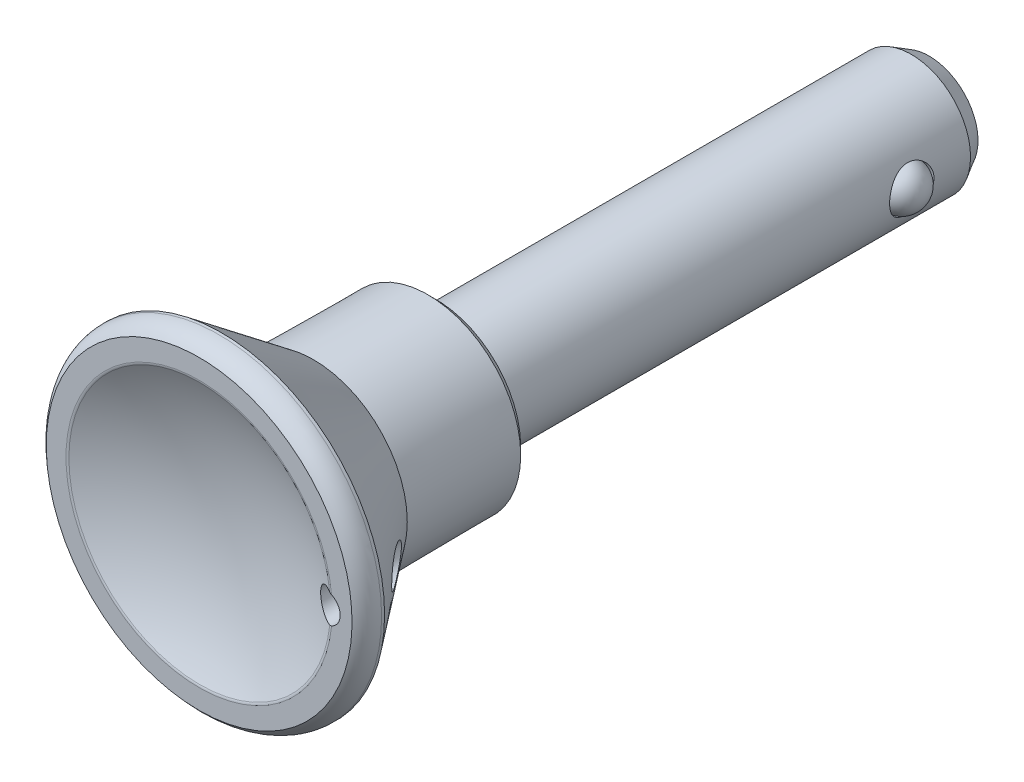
ISO-10303-21;
HEADER;
FILE_DESCRIPTION(('STEP AP214'),'2;1');
FILE_NAME('part.step','',(''),(''),'','','');
FILE_SCHEMA(('AUTOMOTIVE_DESIGN { 1 0 10303 214 1 1 1 1 }'));
ENDSEC;
DATA;
#1=APPLICATION_CONTEXT('core data for automotive mechanical design processes');
#2=APPLICATION_PROTOCOL_DEFINITION('international standard','automotive_design',2000,#1);
#3=PRODUCT_CONTEXT('',#1,'mechanical');
#4=PRODUCT('Part','Part','',(#3));
#5=PRODUCT_RELATED_PRODUCT_CATEGORY('part','',(#4));
#6=PRODUCT_DEFINITION_FORMATION('','',#4);
#7=PRODUCT_DEFINITION_CONTEXT('part definition',#1,'design');
#8=PRODUCT_DEFINITION('design','',#6,#7);
#9=PRODUCT_DEFINITION_SHAPE('','',#8);
#10=(LENGTH_UNIT() NAMED_UNIT(*) SI_UNIT(.MILLI.,.METRE.));
#11=(NAMED_UNIT(*) PLANE_ANGLE_UNIT() SI_UNIT($,.RADIAN.));
#12=(NAMED_UNIT(*) SI_UNIT($,.STERADIAN.) SOLID_ANGLE_UNIT());
#13=UNCERTAINTY_MEASURE_WITH_UNIT(LENGTH_MEASURE(1.E-05),#10,'distance_accuracy_value','');
#14=(GEOMETRIC_REPRESENTATION_CONTEXT(3) GLOBAL_UNCERTAINTY_ASSIGNED_CONTEXT((#13)) GLOBAL_UNIT_ASSIGNED_CONTEXT((#10,
#11,#12)) REPRESENTATION_CONTEXT('',''));
#15=CARTESIAN_POINT('',(0.,0.,0.));
#16=DIRECTION('',(0.,0.,1.));
#17=DIRECTION('',(1.,0.,0.));
#18=AXIS2_PLACEMENT_3D('',#15,#16,#17);
#19=CARTESIAN_POINT('',(0.,0.,23.5));
#20=DIRECTION('',(0.,0.,1.));
#21=DIRECTION('',(0.,-1.,0.));
#22=AXIS2_PLACEMENT_3D('',#19,#20,#21);
#23=TOROIDAL_SURFACE('',#22,13.499629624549,0.50000000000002);
#24=CARTESIAN_POINT('',(13.1832697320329,1.45020836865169,23.940350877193));
#25=CARTESIAN_POINT('',(13.1967898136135,1.44663630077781,23.9473693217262));
#26=CARTESIAN_POINT('',(13.2105528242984,1.44279517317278,23.9537540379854));
#27=CARTESIAN_POINT('',(13.2384329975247,1.43456873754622,23.9652617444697));
#28=CARTESIAN_POINT('',(13.2525500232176,1.43018363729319,23.9703852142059));
#29=CARTESIAN_POINT('',(13.294658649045,1.41639274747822,23.9836925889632));
#30=CARTESIAN_POINT('',(13.322980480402,1.40620303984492,23.9901034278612));
#31=CARTESIAN_POINT('',(13.3645007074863,1.38980064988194,23.9961744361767));
#32=CARTESIAN_POINT('',(13.377775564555,1.38433480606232,23.9976116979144));
#33=CARTESIAN_POINT('',(13.4043485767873,1.37294329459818,23.9995283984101));
#34=CARTESIAN_POINT('',(13.4176457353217,1.3670137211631,23.999998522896));
#35=CARTESIAN_POINT('',(13.430859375,1.3608881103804,24.));
#36=B_SPLINE_CURVE_WITH_KNOTS('',3,(#24,#25,#26,#27,#28,#29,#30,#31,#32,#33,#34,#35),
.UNSPECIFIED.,.F.,.F.,(4,2,2,2,2,4),(0.,0.0468986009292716,0.0937793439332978,0.185591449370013,
0.228845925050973,0.272515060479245),.UNSPECIFIED.);
#37=CARTESIAN_POINT('',(13.1832697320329,1.45020836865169,23.940350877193));
#38=VERTEX_POINT('',#37);
#39=CARTESIAN_POINT('',(13.430859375,1.36088811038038,24.));
#40=VERTEX_POINT('',#39);
#41=EDGE_CURVE('E57',#38,#40,#36,.T.);
#42=ORIENTED_EDGE('',*,*,#41,.T.);
#43=CARTESIAN_POINT('',(0.,0.,24.));
#44=DIRECTION('',(0.,0.,1.));
#45=DIRECTION('',(0.,-1.,0.));
#46=AXIS2_PLACEMENT_3D('',#43,#44,#45);
#47=CIRCLE('',#46,13.499629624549);
#48=CARTESIAN_POINT('',(13.430859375,-1.36088811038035,24.));
#49=VERTEX_POINT('',#48);
#50=EDGE_CURVE('E37',#49,#40,#47,.F.);
#51=ORIENTED_EDGE('',*,*,#50,.F.);
#52=CARTESIAN_POINT('',(13.430859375,-1.36088811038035,24.));
#53=CARTESIAN_POINT('',(13.4166665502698,-1.36746807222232,23.9999984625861));
#54=CARTESIAN_POINT('',(13.4023759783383,-1.37382175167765,23.9994558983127));
#55=CARTESIAN_POINT('',(13.3736641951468,-1.38605678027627,23.9972288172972));
#56=CARTESIAN_POINT('',(13.3592428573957,-1.39193760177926,23.9955430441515));
#57=CARTESIAN_POINT('',(13.316571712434,-1.4085689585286,23.9887845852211));
#58=CARTESIAN_POINT('',(13.2882736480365,-1.41860415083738,23.9820148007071));
#59=CARTESIAN_POINT('',(13.2473798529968,-1.43179699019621,23.9685266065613));
#60=CARTESIAN_POINT('',(13.2344037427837,-1.43578270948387,23.9636790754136));
#61=CARTESIAN_POINT('',(13.2086362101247,-1.44332889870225,23.9528611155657));
#62=CARTESIAN_POINT('',(13.1958479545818,-1.44688469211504,23.9468798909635));
#63=CARTESIAN_POINT('',(13.1832697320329,-1.45020836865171,23.940350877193));
#64=B_SPLINE_CURVE_WITH_KNOTS('',3,(#52,#53,#54,#55,#56,#57,#58,#59,#60,#61,#62,#63),
.UNSPECIFIED.,.F.,.F.,(4,2,2,2,2,4),(0.,0.0469051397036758,0.0938619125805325,0.185680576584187,
0.228880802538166,0.272515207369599),.UNSPECIFIED.);
#65=CARTESIAN_POINT('',(13.1832697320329,-1.4502083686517,23.940350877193));
#66=VERTEX_POINT('',#65);
#67=EDGE_CURVE('E19',#49,#66,#64,.T.);
#68=ORIENTED_EDGE('',*,*,#67,.T.);
#69=CARTESIAN_POINT('',(0.,0.,23.940350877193));
#70=DIRECTION('',(0.,0.,1.));
#71=DIRECTION('',(0.,-1.,0.));
#72=AXIS2_PLACEMENT_3D('',#69,#70,#71);
#73=CIRCLE('',#72,13.2627940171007);
#74=EDGE_CURVE('E52',#38,#66,#73,.T.);
#75=ORIENTED_EDGE('',*,*,#74,.F.);
#76=EDGE_LOOP('',(#42,#51,#68,#75));
#77=FACE_BOUND('',#76,.T.);
#78=ADVANCED_FACE('F14',(#77),#23,.T.);
#79=CARTESIAN_POINT('',(0.,0.,48.6));
#80=DIRECTION('',(0.,-1.,0.));
#81=DIRECTION('',(0.,0.,1.));
#82=AXIS2_PLACEMENT_3D('',#79,#80,#81);
#83=SPHERICAL_SURFACE('',#82,28.);
#84=CARTESIAN_POINT('',(13.1832697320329,1.45020836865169,23.940350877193));
#85=CARTESIAN_POINT('',(13.0915993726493,1.4744532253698,23.8927620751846));
#86=CARTESIAN_POINT('',(12.9980560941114,1.489860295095,23.8443501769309));
#87=CARTESIAN_POINT('',(12.8097591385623,1.50293318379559,23.7471842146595));
#88=CARTESIAN_POINT('',(12.7150040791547,1.50057651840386,23.6984297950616));
#89=CARTESIAN_POINT('',(12.5270201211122,1.47798913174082,23.6019874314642));
#90=CARTESIAN_POINT('',(12.4337919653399,1.45774995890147,23.5543000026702));
#91=CARTESIAN_POINT('',(12.2517517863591,1.39948117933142,23.4614379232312));
#92=CARTESIAN_POINT('',(12.1629377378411,1.36145981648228,23.416262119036));
#93=CARTESIAN_POINT('',(11.9952411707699,1.26934990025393,23.3311736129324));
#94=CARTESIAN_POINT('',(11.9161458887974,1.21575714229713,23.2911465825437));
#95=CARTESIAN_POINT('',(11.7681643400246,1.09295087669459,23.2164149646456));
#96=CARTESIAN_POINT('',(11.6992729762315,1.02374521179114,23.1817077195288));
#97=CARTESIAN_POINT('',(11.5811025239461,0.878735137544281,23.1222729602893));
#98=CARTESIAN_POINT('',(11.5305709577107,0.804216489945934,23.0969048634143));
#99=CARTESIAN_POINT('',(11.4431131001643,0.645771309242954,23.0530473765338));
#100=CARTESIAN_POINT('',(11.4061726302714,0.561854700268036,23.0345508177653));
#101=CARTESIAN_POINT('',(11.3518094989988,0.398913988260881,23.0073479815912));
#102=CARTESIAN_POINT('',(11.332464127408,0.320688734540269,22.9976766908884));
#103=CARTESIAN_POINT('',(11.3065630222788,0.161638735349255,22.9847305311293));
#104=CARTESIAN_POINT('',(11.3000015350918,0.0808151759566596,22.9814527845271));
#105=CARTESIAN_POINT('',(11.2999985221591,-0.0778011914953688,22.9814513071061));
#106=CARTESIAN_POINT('',(11.3060768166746,-0.155594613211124,22.9844877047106));
#107=CARTESIAN_POINT('',(11.3300927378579,-0.308850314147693,22.9964912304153));
#108=CARTESIAN_POINT('',(11.3480306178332,-0.384312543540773,23.0054584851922));
#109=CARTESIAN_POINT('',(11.3948947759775,-0.530632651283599,23.0289063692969));
#110=CARTESIAN_POINT('',(11.4237977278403,-0.601499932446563,23.0433752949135));
#111=CARTESIAN_POINT('',(11.4913996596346,-0.737094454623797,23.0772561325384));
#112=CARTESIAN_POINT('',(11.5301003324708,-0.801820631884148,23.0966688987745));
#113=CARTESIAN_POINT('',(11.6176766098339,-0.9263609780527,23.1406602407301));
#114=CARTESIAN_POINT('',(11.6669073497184,-0.98586052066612,23.1654195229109));
#115=CARTESIAN_POINT('',(11.7728262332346,-1.09578522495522,23.2187793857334));
#116=CARTESIAN_POINT('',(11.8295165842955,-1.14620769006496,23.2473811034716));
#117=CARTESIAN_POINT('',(11.9547131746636,-1.24189507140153,23.3106654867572));
#118=CARTESIAN_POINT('',(12.0238340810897,-1.28614058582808,23.3456702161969));
#119=CARTESIAN_POINT('',(12.1672246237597,-1.36242212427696,23.4184517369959));
#120=CARTESIAN_POINT('',(12.2414976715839,-1.39444996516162,23.4562303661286));
#121=CARTESIAN_POINT('',(12.3592920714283,-1.4344825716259,23.5162885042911));
#122=CARTESIAN_POINT('',(12.4017101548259,-1.44682505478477,23.5379430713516));
#123=CARTESIAN_POINT('',(12.4872184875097,-1.46768648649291,23.5816530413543));
#124=CARTESIAN_POINT('',(12.5303081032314,-1.47620883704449,23.603708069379));
#125=CARTESIAN_POINT('',(12.6602504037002,-1.49604024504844,23.6703078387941));
#126=CARTESIAN_POINT('',(12.7478240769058,-1.50162964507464,23.7153114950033));
#127=CARTESIAN_POINT('',(12.8938293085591,-1.49821627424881,23.7905484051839));
#128=CARTESIAN_POINT('',(12.9524047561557,-1.49339577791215,23.8207882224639));
#129=CARTESIAN_POINT('',(13.0686394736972,-1.47691090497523,23.8809033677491));
#130=CARTESIAN_POINT('',(13.1263001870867,-1.46525870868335,23.9107792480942));
#131=CARTESIAN_POINT('',(13.1832697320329,-1.4502083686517,23.9403508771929));
#132=B_SPLINE_CURVE_WITH_KNOTS('',3,(#84,#85,#86,#87,#88,#89,#90,#91,#92,#93,#94,#95,#96,#97,
#98,#99,#100,#101,#102,#103,#104,#105,#106,#107,#108,#109,#110,#111,#112,#113,#114,#115,#116,
#117,#118,#119,#120,#121,#122,#123,#124,#125,#126,#127,#128,#129,#130,#131),.UNSPECIFIED.,.F.,
.F.,(4,2,2,2,2,2,2,2,2,2,2,2,2,2,2,2,2,2,2,2,2,2,2,4),(0.,0.317865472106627,0.636133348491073,
0.954551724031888,1.27282262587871,1.58190076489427,1.89082399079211,2.16986616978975,
2.44861641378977,2.69085568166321,2.93298589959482,3.16608592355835,3.39919092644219,
3.63180279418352,3.8644548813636,4.10674626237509,4.34910950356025,4.61569988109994,
4.88246850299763,5.02992533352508,5.17725058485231,5.4717357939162,5.66970066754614,
5.86731365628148),.UNSPECIFIED.);
#133=EDGE_CURVE('E48',#38,#66,#132,.T.);
#134=ORIENTED_EDGE('',*,*,#133,.F.);
#135=ORIENTED_EDGE('',*,*,#74,.T.);
#136=EDGE_LOOP('',(#134,#135));
#137=FACE_BOUND('',#136,.T.);
#138=ADVANCED_FACE('F50',(#137),#83,.F.);
#139=CARTESIAN_POINT('',(-15.81,-15.5,24.));
#140=CARTESIAN_POINT('',(-15.5,-15.5,24.));
#141=CARTESIAN_POINT('',(15.5,-15.5,24.));
#142=B_SPLINE_CURVE_WITH_KNOTS('',1,(#139,#140,#141),.UNSPECIFIED.,.F.,.F.,(2,1,2),(-0.01,0.,
1.),.UNSPECIFIED.);
#143=DIRECTION('',(0.,1.,0.));
#144=VECTOR('',#143,1.);
#145=SURFACE_OF_LINEAR_EXTRUSION('',#142,#144);
#146=CARTESIAN_POINT('',(12.8,0.,24.));
#147=DIRECTION('',(0.,0.,1.));
#148=DIRECTION('',(0.,-1.,0.));
#149=AXIS2_PLACEMENT_3D('',#146,#147,#148);
#150=CIRCLE('',#149,1.5);
#151=EDGE_CURVE('E54',#49,#40,#150,.T.);
#152=ORIENTED_EDGE('',*,*,#151,.F.);
#153=ORIENTED_EDGE('',*,*,#50,.T.);
#154=EDGE_LOOP('',(#152,#153));
#155=FACE_BOUND('',#154,.T.);
#156=CARTESIAN_POINT('',(0.,0.,24.));
#157=DIRECTION('',(0.,0.,1.));
#158=DIRECTION('',(0.,-1.,0.));
#159=AXIS2_PLACEMENT_3D('',#156,#157,#158);
#160=CIRCLE('',#159,15.5);
#161=CARTESIAN_POINT('',(0.,-15.5,24.));
#162=VERTEX_POINT('',#161);
#163=EDGE_CURVE('E55',#162,#162,#160,.F.);
#164=ORIENTED_EDGE('',*,*,#163,.F.);
#165=EDGE_LOOP('',(#164));
#166=FACE_BOUND('',#165,.T.);
#167=ADVANCED_FACE('F179',(#155,#166),#145,.T.);
#168=CARTESIAN_POINT('',(0.,0.,22.));
#169=DIRECTION('',(0.,0.,1.));
#170=DIRECTION('',(0.,-1.,0.));
#171=AXIS2_PLACEMENT_3D('',#168,#169,#170);
#172=TOROIDAL_SURFACE('',#171,14.,2.5);
#173=ORIENTED_EDGE('',*,*,#163,.T.);
#174=EDGE_LOOP('',(#173));
#175=FACE_BOUND('',#174,.T.);
#176=CARTESIAN_POINT('',(0.,0.,22.));
#177=DIRECTION('',(0.,0.,1.));
#178=DIRECTION('',(1.,0.,0.));
#179=AXIS2_PLACEMENT_3D('',#176,#177,#178);
#180=CIRCLE('',#179,16.5);
#181=CARTESIAN_POINT('',(16.5,0.,22.));
#182=VERTEX_POINT('',#181);
#183=EDGE_CURVE('E93',#182,#182,#180,.F.);
#184=ORIENTED_EDGE('',*,*,#183,.F.);
#185=EDGE_LOOP('',(#184));
#186=FACE_BOUND('',#185,.T.);
#187=ADVANCED_FACE('F72',(#175,#186),#172,.T.);
#188=CARTESIAN_POINT('',(12.8,0.,14.7910576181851));
#189=DIRECTION('',(0.,0.,1.));
#190=DIRECTION('',(0.,-1.,0.));
#191=AXIS2_PLACEMENT_3D('',#188,#189,#190);
#192=CYLINDRICAL_SURFACE('',#191,1.5);
#193=CARTESIAN_POINT('',(12.62421875,-1.48966471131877,16.6671130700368));
#194=CARTESIAN_POINT('',(12.6920032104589,-1.49766166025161,16.7577945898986));
#195=CARTESIAN_POINT('',(12.7603283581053,-1.50104579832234,16.8484671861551));
#196=CARTESIAN_POINT('',(12.897645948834,-1.49839397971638,17.0292601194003));
#197=CARTESIAN_POINT('',(12.9666387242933,-1.49235306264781,17.1193801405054));
#198=CARTESIAN_POINT('',(13.1046564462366,-1.47039580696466,17.2982798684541));
#199=CARTESIAN_POINT('',(13.1736813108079,-1.45448817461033,17.3870606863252));
#200=CARTESIAN_POINT('',(13.3110827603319,-1.41207641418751,17.5624849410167));
#201=CARTESIAN_POINT('',(13.3794598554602,-1.38558148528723,17.6491301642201));
#202=CARTESIAN_POINT('',(13.5187485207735,-1.31898430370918,17.8243946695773));
#203=CARTESIAN_POINT('',(13.5895656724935,-1.27816038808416,17.9128199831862));
#204=CARTESIAN_POINT('',(13.7277317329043,-1.18169522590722,18.084148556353));
#205=CARTESIAN_POINT('',(13.7950853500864,-1.12607476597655,18.1670593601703));
#206=CARTESIAN_POINT('',(13.9084086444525,-1.01303116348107,18.3057043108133));
#207=CARTESIAN_POINT('',(13.9556726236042,-0.959133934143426,18.3632332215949));
#208=CARTESIAN_POINT('',(14.0446143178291,-0.840483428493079,18.471045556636));
#209=CARTESIAN_POINT('',(14.0863013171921,-0.775748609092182,18.5213410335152));
#210=CARTESIAN_POINT('',(14.1507925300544,-0.654717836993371,18.5988956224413));
#211=CARTESIAN_POINT('',(14.1756178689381,-0.601120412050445,18.6286642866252));
#212=CARTESIAN_POINT('',(14.2195452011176,-0.488403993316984,18.6812412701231));
#213=CARTESIAN_POINT('',(14.238652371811,-0.429290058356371,18.7040558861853));
#214=CARTESIAN_POINT('',(14.2689681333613,-0.309460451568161,18.7402118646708));
#215=CARTESIAN_POINT('',(14.2805052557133,-0.248950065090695,18.7539474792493));
#216=CARTESIAN_POINT('',(14.2960184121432,-0.12562551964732,18.77240966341));
#217=CARTESIAN_POINT('',(14.3000000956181,-0.0628131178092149,18.7771429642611));
#218=CARTESIAN_POINT('',(14.2999999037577,0.0632231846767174,18.7771427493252));
#219=CARTESIAN_POINT('',(14.2959658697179,0.126447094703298,18.7723472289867));
#220=CARTESIAN_POINT('',(14.2802519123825,0.250551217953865,18.7536458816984));
#221=CARTESIAN_POINT('',(14.2685662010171,0.311429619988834,18.7397331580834));
#222=CARTESIAN_POINT('',(14.2387365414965,0.428564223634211,18.7041556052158));
#223=CARTESIAN_POINT('',(14.2206451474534,0.484853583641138,18.6825538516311));
#224=CARTESIAN_POINT('',(14.1792492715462,0.592453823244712,18.633014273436));
#225=CARTESIAN_POINT('',(14.1559422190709,0.643762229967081,18.6050733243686));
#226=CARTESIAN_POINT('',(14.0931329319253,0.764461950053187,18.5295741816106));
#227=CARTESIAN_POINT('',(14.0512237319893,0.830727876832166,18.4790335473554));
#228=CARTESIAN_POINT('',(13.9615408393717,0.952125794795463,18.370367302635));
#229=CARTESIAN_POINT('',(13.9137529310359,1.00722990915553,18.3122232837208));
#230=CARTESIAN_POINT('',(13.7883270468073,1.13348006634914,18.1588182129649));
#231=CARTESIAN_POINT('',(13.708179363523,1.1978805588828,18.0600849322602));
#232=CARTESIAN_POINT('',(13.5435609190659,1.3064664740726,17.8554996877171));
#233=CARTESIAN_POINT('',(13.4590828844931,1.35061655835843,17.7496356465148));
#234=CARTESIAN_POINT('',(13.3107013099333,1.41202717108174,17.5619635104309));
#235=CARTESIAN_POINT('',(13.2471965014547,1.43330058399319,17.4811068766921));
#236=CARTESIAN_POINT('',(13.1198264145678,1.46698834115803,17.3177942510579));
#237=CARTESIAN_POINT('',(13.0559609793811,1.47939847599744,17.2353375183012));
#238=CARTESIAN_POINT('',(12.9282718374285,1.49589397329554,17.0692879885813));
#239=CARTESIAN_POINT('',(12.8644485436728,1.49996064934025,16.9856930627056));
#240=CARTESIAN_POINT('',(12.7374091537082,1.5000387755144,16.8180712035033));
#241=CARTESIAN_POINT('',(12.6741929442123,1.49605175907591,16.7340443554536));
#242=CARTESIAN_POINT('',(12.5469978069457,1.47993658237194,16.5637117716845));
#243=CARTESIAN_POINT('',(12.4830456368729,1.46758777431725,16.4774068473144));
#244=CARTESIAN_POINT('',(12.3565302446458,1.43443826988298,16.3053467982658));
#245=CARTESIAN_POINT('',(12.2939675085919,1.41363466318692,16.2195918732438));
#246=CARTESIAN_POINT('',(12.1709555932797,1.36334219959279,16.0496685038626));
#247=CARTESIAN_POINT('',(12.1104987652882,1.33388949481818,15.9654949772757));
#248=CARTESIAN_POINT('',(11.9920388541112,1.26565016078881,15.7992974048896));
#249=CARTESIAN_POINT('',(11.9340336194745,1.2268719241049,15.7172714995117));
#250=CARTESIAN_POINT('',(11.8266654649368,1.14315320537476,15.5643050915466));
#251=CARTESIAN_POINT('',(11.7770073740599,1.09916121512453,15.4930561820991));
#252=CARTESIAN_POINT('',(11.6811267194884,1.0014126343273,15.3545942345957));
#253=CARTESIAN_POINT('',(11.6349116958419,0.947635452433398,15.2873901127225));
#254=CARTESIAN_POINT('',(11.5691423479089,0.858125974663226,15.1911821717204));
#255=CARTESIAN_POINT('',(11.5476572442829,0.826531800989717,15.1596504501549));
#256=CARTESIAN_POINT('',(11.5063433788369,0.760253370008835,15.0988444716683));
#257=CARTESIAN_POINT('',(11.4865152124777,0.725568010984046,15.0695710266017));
#258=CARTESIAN_POINT('',(11.4302732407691,0.616814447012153,14.9863165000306));
#259=CARTESIAN_POINT('',(11.3967954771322,0.537651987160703,14.9364517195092));
#260=CARTESIAN_POINT('',(11.3555291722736,0.407099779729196,14.8747804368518));
#261=CARTESIAN_POINT('',(11.3430899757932,0.360365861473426,14.856144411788));
#262=CARTESIAN_POINT('',(11.3225831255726,0.263914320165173,14.8253840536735));
#263=CARTESIAN_POINT('',(11.3145046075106,0.214204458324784,14.8132435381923));
#264=CARTESIAN_POINT('',(11.3059949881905,0.136701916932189,14.8004485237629));
#265=CARTESIAN_POINT('',(11.3037543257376,0.109528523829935,14.7970776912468));
#266=CARTESIAN_POINT('',(11.300755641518,0.0549082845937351,14.7925658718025));
#267=CARTESIAN_POINT('',(11.2999979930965,0.0274613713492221,14.791425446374));
#268=CARTESIAN_POINT('',(11.3000036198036,-0.04953141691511,14.7914342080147));
#269=CARTESIAN_POINT('',(11.3024785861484,-0.0991098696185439,14.7951600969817));
#270=CARTESIAN_POINT('',(11.3121472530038,-0.196763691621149,14.8096998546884));
#271=CARTESIAN_POINT('',(11.3193489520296,-0.244836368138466,14.8205257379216));
#272=CARTESIAN_POINT('',(11.3399096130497,-0.348584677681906,14.851379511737));
#273=CARTESIAN_POINT('',(11.3542736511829,-0.40361058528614,14.8729064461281));
#274=CARTESIAN_POINT('',(11.387815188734,-0.508718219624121,14.9230284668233));
#275=CARTESIAN_POINT('',(11.4070004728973,-0.558791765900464,14.9516349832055));
#276=CARTESIAN_POINT('',(11.4595328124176,-0.677671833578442,15.0296959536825));
#277=CARTESIAN_POINT('',(11.4951602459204,-0.743300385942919,15.0824162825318));
#278=CARTESIAN_POINT('',(11.5718624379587,-0.864190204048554,15.1952386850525));
#279=CARTESIAN_POINT('',(11.6129512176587,-0.919423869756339,15.2553597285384));
#280=CARTESIAN_POINT('',(11.6921657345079,-1.01283475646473,15.3705343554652));
#281=CARTESIAN_POINT('',(11.7297508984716,-1.05232856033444,15.4249113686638));
#282=CARTESIAN_POINT('',(11.8070065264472,-1.12552131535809,15.5360737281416));
#283=CARTESIAN_POINT('',(11.8466784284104,-1.15921620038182,15.5928607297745));
#284=CARTESIAN_POINT('',(11.9276586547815,-1.22132048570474,15.7081342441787));
#285=CARTESIAN_POINT('',(11.9689673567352,-1.24972865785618,15.7666211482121));
#286=CARTESIAN_POINT('',(12.0529136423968,-1.30165144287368,15.884812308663));
#287=CARTESIAN_POINT('',(12.0955516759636,-1.32516437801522,15.9445169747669));
#288=CARTESIAN_POINT('',(12.2167649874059,-1.38470455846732,16.1132939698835));
#289=CARTESIAN_POINT('',(12.2965837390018,-1.41552588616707,16.2233378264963));
#290=CARTESIAN_POINT('',(12.458735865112,-1.46310486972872,16.4446295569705));
#291=CARTESIAN_POINT('',(12.5410705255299,-1.47985520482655,16.5558780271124));
#292=CARTESIAN_POINT('',(12.62421875,-1.48966471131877,16.6671130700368));
#293=B_SPLINE_CURVE_WITH_KNOTS('',3,(#193,#194,#195,#196,#197,#198,#199,#200,#201,#202,#203,
#204,#205,#206,#207,#208,#209,#210,#211,#212,#213,#214,#215,#216,#217,#218,#219,#220,#221,#222,
#223,#224,#225,#226,#227,#228,#229,#230,#231,#232,#233,#234,#235,#236,#237,#238,#239,#240,#241,
#242,#243,#244,#245,#246,#247,#248,#249,#250,#251,#252,#253,#254,#255,#256,#257,#258,#259,#260,
#261,#262,#263,#264,#265,#266,#267,#268,#269,#270,#271,#272,#273,#274,#275,#276,#277,#278,#279,
#280,#281,#282,#283,#284,#285,#286,#287,#288,#289,#290,#291,#292),.UNSPECIFIED.,.T.,.F.,(4,2,2,
2,2,2,2,2,2,2,2,2,2,2,2,2,2,2,2,2,2,2,2,2,2,2,2,2,2,2,2,2,2,2,2,2,2,2,2,2,2,2,2,2,2,2,2,2,2,4),
(0.,0.3403810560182,0.680941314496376,1.02120149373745,1.36116666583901,1.72154948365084,
2.08142867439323,2.35634247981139,2.63079277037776,2.82853330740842,3.02609425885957,
3.21438583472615,3.40253656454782,3.59191561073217,3.78143807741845,3.96944036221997,
4.15753551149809,4.43581804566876,4.71478725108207,5.14007838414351,5.56610888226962,
5.88069336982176,6.19542716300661,6.51086508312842,6.82624294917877,7.15028500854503,
7.47443870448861,7.79725631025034,8.11978447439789,8.41136093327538,8.70355821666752,
8.8520054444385,9.00050579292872,9.29551066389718,9.45047012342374,9.60504170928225,
9.68734372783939,9.76966646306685,9.91815000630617,10.0668854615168,10.2482950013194,
10.4299993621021,10.702706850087,10.9761285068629,11.2068168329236,11.4376662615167,
11.6685692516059,11.8995512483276,12.3168647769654,12.7343952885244),.UNSPECIFIED.);
#294=CARTESIAN_POINT('',(12.62421875,-1.48966471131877,16.6671130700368));
#295=VERTEX_POINT('',#294);
#296=EDGE_CURVE('E86',#295,#295,#293,.T.);
#297=ORIENTED_EDGE('',*,*,#296,.F.);
#298=EDGE_LOOP('',(#297));
#299=FACE_BOUND('',#298,.T.);
#300=ORIENTED_EDGE('',*,*,#67,.F.);
#301=ORIENTED_EDGE('',*,*,#151,.T.);
#302=ORIENTED_EDGE('',*,*,#41,.F.);
#303=ORIENTED_EDGE('',*,*,#133,.T.);
#304=EDGE_LOOP('',(#300,#301,#302,#303));
#305=FACE_BOUND('',#304,.T.);
#306=ADVANCED_FACE('F58',(#299,#305),#192,.F.);
#307=CARTESIAN_POINT('',(0.,0.,22.));
#308=DIRECTION('',(0.,0.,1.));
#309=DIRECTION('',(0.,-1.,0.));
#310=AXIS2_PLACEMENT_3D('',#307,#308,#309);
#311=CYLINDRICAL_SURFACE('',#310,16.5);
#312=ORIENTED_EDGE('',*,*,#183,.T.);
#313=EDGE_LOOP('',(#312));
#314=FACE_BOUND('',#313,.T.);
#315=CARTESIAN_POINT('',(0.,0.,21.7));
#316=DIRECTION('',(0.,0.,-1.));
#317=DIRECTION('',(1.,0.,0.));
#318=AXIS2_PLACEMENT_3D('',#315,#316,#317);
#319=CIRCLE('',#318,16.5);
#320=CARTESIAN_POINT('',(16.5,0.,21.7));
#321=VERTEX_POINT('',#320);
#322=EDGE_CURVE('E92',#321,#321,#319,.T.);
#323=ORIENTED_EDGE('',*,*,#322,.F.);
#324=EDGE_LOOP('',(#323));
#325=FACE_BOUND('',#324,.T.);
#326=ADVANCED_FACE('F71',(#314,#325),#311,.T.);
#327=CARTESIAN_POINT('',(0.,0.,12.4));
#328=DIRECTION('',(0.,0.,1.));
#329=DIRECTION('',(0.,-1.,0.));
#330=AXIS2_PLACEMENT_3D('',#327,#328,#329);
#331=CONICAL_SURFACE('',#330,9.5,0.645219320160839);
#332=ORIENTED_EDGE('',*,*,#296,.T.);
#333=EDGE_LOOP('',(#332));
#334=FACE_BOUND('',#333,.T.);
#335=ORIENTED_EDGE('',*,*,#322,.T.);
#336=EDGE_LOOP('',(#335));
#337=FACE_BOUND('',#336,.T.);
#338=CARTESIAN_POINT('',(0.,0.,12.4));
#339=DIRECTION('',(0.,0.,-1.));
#340=DIRECTION('',(1.,0.,0.));
#341=AXIS2_PLACEMENT_3D('',#338,#339,#340);
#342=CIRCLE('',#341,9.5);
#343=CARTESIAN_POINT('',(9.5,0.,12.4));
#344=VERTEX_POINT('',#343);
#345=EDGE_CURVE('E163',#344,#344,#342,.T.);
#346=ORIENTED_EDGE('',*,*,#345,.F.);
#347=EDGE_LOOP('',(#346));
#348=FACE_BOUND('',#347,.T.);
#349=ADVANCED_FACE('F94',(#334,#337,#348),#331,.T.);
#350=CARTESIAN_POINT('',(0.,0.,0.799969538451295));
#351=DIRECTION('',(0.,0.,1.));
#352=DIRECTION('',(0.,-1.,0.));
#353=AXIS2_PLACEMENT_3D('',#350,#351,#352);
#354=CONICAL_SURFACE('',#353,9.39876806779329,0.00872664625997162);
#355=ORIENTED_EDGE('',*,*,#345,.T.);
#356=EDGE_LOOP('',(#355));
#357=FACE_BOUND('',#356,.T.);
#358=CARTESIAN_POINT('',(0.,0.,0.799969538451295));
#359=DIRECTION('',(0.,0.,-1.));
#360=DIRECTION('',(1.,0.,0.));
#361=AXIS2_PLACEMENT_3D('',#358,#359,#360);
#362=CIRCLE('',#361,9.39876806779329);
#363=CARTESIAN_POINT('',(9.39876806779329,0.,0.799969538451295));
#364=VERTEX_POINT('',#363);
#365=EDGE_CURVE('E160',#364,#364,#362,.T.);
#366=ORIENTED_EDGE('',*,*,#365,.F.);
#367=EDGE_LOOP('',(#366));
#368=FACE_BOUND('',#367,.T.);
#369=ADVANCED_FACE('F98',(#357,#368),#354,.T.);
#370=CARTESIAN_POINT('',(0.,0.,0.));
#371=DIRECTION('',(0.,0.,1.));
#372=DIRECTION('',(0.,-1.,0.));
#373=AXIS2_PLACEMENT_3D('',#370,#371,#372);
#374=CONICAL_SURFACE('',#373,8.59178683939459,0.789761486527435);
#375=ORIENTED_EDGE('',*,*,#365,.T.);
#376=EDGE_LOOP('',(#375));
#377=FACE_BOUND('',#376,.T.);
#378=CARTESIAN_POINT('',(0.,0.,0.));
#379=DIRECTION('',(0.,0.,1.));
#380=DIRECTION('',(0.,-1.,0.));
#381=AXIS2_PLACEMENT_3D('',#378,#379,#380);
#382=CIRCLE('',#381,8.59178683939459);
#383=CARTESIAN_POINT('',(0.,-8.59178683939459,0.));
#384=VERTEX_POINT('',#383);
#385=EDGE_CURVE('E30',#384,#384,#382,.F.);
#386=ORIENTED_EDGE('',*,*,#385,.F.);
#387=EDGE_LOOP('',(#386));
#388=FACE_BOUND('',#387,.T.);
#389=ADVANCED_FACE('F102',(#377,#388),#374,.T.);
#390=CARTESIAN_POINT('',(8.5917868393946,-8.69489038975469,0.));
#391=DIRECTION('',(0.,0.,-1.));
#392=DIRECTION('',(-1.,0.,0.));
#393=AXIS2_PLACEMENT_3D('',#390,#391,#392);
#394=PLANE('',#393);
#395=CARTESIAN_POINT('',(0.,0.,0.));
#396=DIRECTION('',(0.,0.,1.));
#397=DIRECTION('',(0.,-1.,0.));
#398=AXIS2_PLACEMENT_3D('',#395,#396,#397);
#399=CIRCLE('',#398,6.);
#400=CARTESIAN_POINT('',(0.,-6.,0.));
#401=VERTEX_POINT('',#400);
#402=EDGE_CURVE('E9',#401,#401,#399,.F.);
#403=ORIENTED_EDGE('',*,*,#402,.F.);
#404=EDGE_LOOP('',(#403));
#405=FACE_BOUND('',#404,.T.);
#406=ORIENTED_EDGE('',*,*,#385,.T.);
#407=EDGE_LOOP('',(#406));
#408=FACE_BOUND('',#407,.T.);
#409=ADVANCED_FACE('F106',(#405,#408),#394,.T.);
#410=CARTESIAN_POINT('',(0.,0.,0.));
#411=DIRECTION('',(0.,0.,1.));
#412=DIRECTION('',(0.,-1.,0.));
#413=AXIS2_PLACEMENT_3D('',#410,#411,#412);
#414=CYLINDRICAL_SURFACE('',#413,6.);
#415=ORIENTED_EDGE('',*,*,#402,.T.);
#416=EDGE_LOOP('',(#415));
#417=FACE_BOUND('',#416,.T.);
#418=CARTESIAN_POINT('',(6.,0.,-40.));
#419=CARTESIAN_POINT('',(5.99999462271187,0.121667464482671,-40.000007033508));
#420=CARTESIAN_POINT('',(5.9962597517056,0.243448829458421,-40.0099159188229));
#421=CARTESIAN_POINT('',(5.98170081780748,0.483504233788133,-40.0491900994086));
#422=CARTESIAN_POINT('',(5.97086593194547,0.601772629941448,-40.0785850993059));
#423=CARTESIAN_POINT('',(5.9432796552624,0.831103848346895,-40.1556365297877));
#424=CARTESIAN_POINT('',(5.92654369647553,0.942184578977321,-40.203245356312));
#425=CARTESIAN_POINT('',(5.88882492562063,1.15473323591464,-40.3151801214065));
#426=CARTESIAN_POINT('',(5.86784233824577,1.25620167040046,-40.3795051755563));
#427=CARTESIAN_POINT('',(5.82279419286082,1.4510168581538,-40.5259171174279));
#428=CARTESIAN_POINT('',(5.79864114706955,1.54390166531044,-40.6085915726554));
#429=CARTESIAN_POINT('',(5.75040444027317,1.71486282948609,-40.7881111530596));
#430=CARTESIAN_POINT('',(5.72632080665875,1.79293396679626,-40.8849612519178));
#431=CARTESIAN_POINT('',(5.67993703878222,1.93497305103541,-41.0945762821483));
#432=CARTESIAN_POINT('',(5.65773970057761,1.99829097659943,-41.2078067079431));
#433=CARTESIAN_POINT('',(5.61899788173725,2.104779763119,-41.4442726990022));
#434=CARTESIAN_POINT('',(5.60245113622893,2.14795869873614,-41.567504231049));
#435=CARTESIAN_POINT('',(5.5778161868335,2.21112647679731,-41.8151751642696));
#436=CARTESIAN_POINT('',(5.56940885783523,2.23199391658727,-41.9393576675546));
#437=CARTESIAN_POINT('',(5.56107092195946,2.25269334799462,-42.1897243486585));
#438=CARTESIAN_POINT('',(5.56113680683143,2.25253404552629,-42.315907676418));
#439=CARTESIAN_POINT('',(5.56946266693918,2.23185646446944,-42.5586540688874));
#440=CARTESIAN_POINT('',(5.57723200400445,2.21255720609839,-42.6753409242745));
#441=CARTESIAN_POINT('',(5.59927401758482,2.15616264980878,-42.9036803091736));
#442=CARTESIAN_POINT('',(5.61354769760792,2.11906460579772,-43.0153320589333));
#443=CARTESIAN_POINT('',(5.64728592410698,2.02745519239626,-43.2329181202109));
#444=CARTESIAN_POINT('',(5.6668436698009,1.97262730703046,-43.3387040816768));
#445=CARTESIAN_POINT('',(5.70891418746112,1.84733776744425,-43.5399230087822));
#446=CARTESIAN_POINT('',(5.73142784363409,1.77687143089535,-43.6353528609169));
#447=CARTESIAN_POINT('',(5.7787168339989,1.61673979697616,-43.8198908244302));
#448=CARTESIAN_POINT('',(5.80354258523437,1.52610382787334,-43.9081456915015));
#449=CARTESIAN_POINT('',(5.85136882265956,1.33099961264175,-44.0684848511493));
#450=CARTESIAN_POINT('',(5.87436846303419,1.22652501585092,-44.1405616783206));
#451=CARTESIAN_POINT('',(5.9164128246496,1.00450158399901,-44.2674460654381));
#452=CARTESIAN_POINT('',(5.93538783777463,0.886769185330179,-44.3219566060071));
#453=CARTESIAN_POINT('',(5.96670045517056,0.643032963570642,-44.4100294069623));
#454=CARTESIAN_POINT('',(5.97905147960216,0.517046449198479,-44.4436340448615));
#455=CARTESIAN_POINT('',(5.99154588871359,0.324874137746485,-44.4773780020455));
#456=CARTESIAN_POINT('',(5.99470542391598,0.260242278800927,-44.4858488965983));
#457=CARTESIAN_POINT('',(5.99893391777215,0.130417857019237,-44.4971617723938));
#458=CARTESIAN_POINT('',(6.00000288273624,0.0652252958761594,-44.5000037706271));
#459=CARTESIAN_POINT('',(5.99999462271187,-0.121667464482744,-44.499992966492));
#460=CARTESIAN_POINT('',(5.9962597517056,-0.243448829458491,-44.4900840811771));
#461=CARTESIAN_POINT('',(5.98170081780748,-0.483504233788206,-44.4508099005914));
#462=CARTESIAN_POINT('',(5.97086593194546,-0.601772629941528,-44.4214149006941));
#463=CARTESIAN_POINT('',(5.9432796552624,-0.831103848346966,-44.3443634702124));
#464=CARTESIAN_POINT('',(5.92654369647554,-0.942184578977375,-44.296754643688));
#465=CARTESIAN_POINT('',(5.88882492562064,-1.1547332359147,-44.1848198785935));
#466=CARTESIAN_POINT('',(5.86784233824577,-1.25620167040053,-44.1204948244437));
#467=CARTESIAN_POINT('',(5.82279419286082,-1.45101685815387,-43.9740828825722));
#468=CARTESIAN_POINT('',(5.79864114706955,-1.5439016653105,-43.8914084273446));
#469=CARTESIAN_POINT('',(5.75040444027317,-1.71486282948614,-43.7118888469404));
#470=CARTESIAN_POINT('',(5.72632080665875,-1.79293396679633,-43.6150387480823));
#471=CARTESIAN_POINT('',(5.67993703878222,-1.93497305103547,-43.4054237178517));
#472=CARTESIAN_POINT('',(5.65773970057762,-1.99829097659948,-43.292193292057));
#473=CARTESIAN_POINT('',(5.61899788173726,-2.10477976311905,-43.0557273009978));
#474=CARTESIAN_POINT('',(5.60245113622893,-2.1479586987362,-42.9324957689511));
#475=CARTESIAN_POINT('',(5.5778161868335,-2.21112647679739,-42.6848248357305));
#476=CARTESIAN_POINT('',(5.56940885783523,-2.23199391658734,-42.5606423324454));
#477=CARTESIAN_POINT('',(5.56107092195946,-2.25269334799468,-42.3102756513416));
#478=CARTESIAN_POINT('',(5.56113680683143,-2.25253404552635,-42.184092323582));
#479=CARTESIAN_POINT('',(5.56946266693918,-2.23185646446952,-41.9413459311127));
#480=CARTESIAN_POINT('',(5.57723200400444,-2.21255720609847,-41.8246590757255));
#481=CARTESIAN_POINT('',(5.59927401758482,-2.15616264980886,-41.5963196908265));
#482=CARTESIAN_POINT('',(5.61354769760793,-2.11906460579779,-41.4846679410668));
#483=CARTESIAN_POINT('',(5.64728592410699,-2.02745519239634,-41.2670818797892));
#484=CARTESIAN_POINT('',(5.66684366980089,-1.97262730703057,-41.1612959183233));
#485=CARTESIAN_POINT('',(5.7089141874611,-1.84733776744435,-40.9600769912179));
#486=CARTESIAN_POINT('',(5.73142784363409,-1.77687143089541,-40.8646471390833));
#487=CARTESIAN_POINT('',(5.7787168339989,-1.61673979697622,-40.6801091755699));
#488=CARTESIAN_POINT('',(5.80354258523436,-1.52610382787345,-40.5918543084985));
#489=CARTESIAN_POINT('',(5.85136882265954,-1.33099961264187,-40.4315151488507));
#490=CARTESIAN_POINT('',(5.87436846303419,-1.22652501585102,-40.3594383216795));
#491=CARTESIAN_POINT('',(5.9164128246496,-1.00450158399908,-40.232553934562));
#492=CARTESIAN_POINT('',(5.93538783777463,-0.886769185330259,-40.1780433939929));
#493=CARTESIAN_POINT('',(5.96670045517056,-0.643032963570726,-40.0899705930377));
#494=CARTESIAN_POINT('',(5.97905147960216,-0.517046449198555,-40.0563659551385));
#495=CARTESIAN_POINT('',(5.99154588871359,-0.324874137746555,-40.0226219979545));
#496=CARTESIAN_POINT('',(5.99470542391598,-0.260242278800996,-40.0141511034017));
#497=CARTESIAN_POINT('',(5.99893391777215,-0.130417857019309,-40.0028382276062));
#498=CARTESIAN_POINT('',(6.00000288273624,-0.0652252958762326,-39.9999962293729));
#499=CARTESIAN_POINT('',(6.,0.,-40.));
#500=B_SPLINE_CURVE_WITH_KNOTS('',3,(#418,#419,#420,#421,#422,#423,#424,#425,#426,#427,#428,
#429,#430,#431,#432,#433,#434,#435,#436,#437,#438,#439,#440,#441,#442,#443,#444,#445,#446,#447,
#448,#449,#450,#451,#452,#453,#454,#455,#456,#457,#458,#459,#460,#461,#462,#463,#464,#465,#466,
#467,#468,#469,#470,#471,#472,#473,#474,#475,#476,#477,#478,#479,#480,#481,#482,#483,#484,#485,
#486,#487,#488,#489,#490,#491,#492,#493,#494,#495,#496,#497,#498,#499),.UNSPECIFIED.,.T.,.F.,(4,
2,2,2,2,2,2,2,2,2,2,2,2,2,2,2,2,2,2,2,2,2,2,2,2,2,2,2,2,2,2,2,2,2,2,2,2,2,2,2,4),(0.,
0.364749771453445,0.730056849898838,1.09441560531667,1.45875508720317,1.83709555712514,
2.21556909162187,2.60845040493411,3.00117405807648,3.37778829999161,3.75424660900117,
4.10817453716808,4.46215708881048,4.8228444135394,5.18363987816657,5.56863323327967,
5.95380388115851,6.34518169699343,6.73576355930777,6.9313046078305,7.12684506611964,
7.49159483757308,7.85690191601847,8.22126067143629,8.5856001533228,8.96394062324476,
9.34241415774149,9.73529547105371,10.128019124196,10.5046333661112,10.8810916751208,
11.2350196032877,11.5890021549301,11.949689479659,12.3104849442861,12.6954782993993,
13.0806489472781,13.4720267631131,13.8626086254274,14.0581496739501,14.2536901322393),.UNSPECIFIED.);
#501=CARTESIAN_POINT('',(6.,0.,-40.));
#502=VERTEX_POINT('',#501);
#503=EDGE_CURVE('E123',#502,#502,#500,.T.);
#504=ORIENTED_EDGE('',*,*,#503,.T.);
#505=EDGE_LOOP('',(#504));
#506=FACE_BOUND('',#505,.T.);
#507=CARTESIAN_POINT('',(-6.,0.,-40.));
#508=CARTESIAN_POINT('',(-5.99999462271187,0.121667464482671,-40.000007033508));
#509=CARTESIAN_POINT('',(-5.9962597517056,0.243448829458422,-40.0099159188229));
#510=CARTESIAN_POINT('',(-5.98170081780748,0.483504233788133,-40.0491900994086));
#511=CARTESIAN_POINT('',(-5.97086593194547,0.601772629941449,-40.0785850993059));
#512=CARTESIAN_POINT('',(-5.9432796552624,0.831103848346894,-40.1556365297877));
#513=CARTESIAN_POINT('',(-5.92654369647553,0.942184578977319,-40.203245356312));
#514=CARTESIAN_POINT('',(-5.88882492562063,1.15473323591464,-40.3151801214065));
#515=CARTESIAN_POINT('',(-5.86784233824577,1.25620167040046,-40.3795051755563));
#516=CARTESIAN_POINT('',(-5.82279419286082,1.4510168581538,-40.5259171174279));
#517=CARTESIAN_POINT('',(-5.79864114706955,1.54390166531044,-40.6085915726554));
#518=CARTESIAN_POINT('',(-5.75040444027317,1.71486282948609,-40.7881111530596));
#519=CARTESIAN_POINT('',(-5.72632080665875,1.79293396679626,-40.8849612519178));
#520=CARTESIAN_POINT('',(-5.67993703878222,1.93497305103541,-41.0945762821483));
#521=CARTESIAN_POINT('',(-5.65773970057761,1.99829097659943,-41.2078067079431));
#522=CARTESIAN_POINT('',(-5.61899788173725,2.104779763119,-41.4442726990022));
#523=CARTESIAN_POINT('',(-5.60245113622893,2.14795869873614,-41.567504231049));
#524=CARTESIAN_POINT('',(-5.5778161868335,2.21112647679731,-41.8151751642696));
#525=CARTESIAN_POINT('',(-5.56940885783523,2.23199391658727,-41.9393576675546));
#526=CARTESIAN_POINT('',(-5.56107092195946,2.25269334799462,-42.1897243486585));
#527=CARTESIAN_POINT('',(-5.56113680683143,2.25253404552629,-42.315907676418));
#528=CARTESIAN_POINT('',(-5.56946266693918,2.23185646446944,-42.5586540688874));
#529=CARTESIAN_POINT('',(-5.57723200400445,2.21255720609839,-42.6753409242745));
#530=CARTESIAN_POINT('',(-5.59927401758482,2.15616264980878,-42.9036803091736));
#531=CARTESIAN_POINT('',(-5.61354769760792,2.11906460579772,-43.0153320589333));
#532=CARTESIAN_POINT('',(-5.64728592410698,2.02745519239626,-43.2329181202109));
#533=CARTESIAN_POINT('',(-5.6668436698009,1.97262730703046,-43.3387040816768));
#534=CARTESIAN_POINT('',(-5.70891418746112,1.84733776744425,-43.5399230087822));
#535=CARTESIAN_POINT('',(-5.73142784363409,1.77687143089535,-43.6353528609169));
#536=CARTESIAN_POINT('',(-5.7787168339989,1.61673979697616,-43.8198908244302));
#537=CARTESIAN_POINT('',(-5.80354258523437,1.52610382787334,-43.9081456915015));
#538=CARTESIAN_POINT('',(-5.85136882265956,1.33099961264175,-44.0684848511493));
#539=CARTESIAN_POINT('',(-5.87436846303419,1.22652501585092,-44.1405616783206));
#540=CARTESIAN_POINT('',(-5.9164128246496,1.00450158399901,-44.2674460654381));
#541=CARTESIAN_POINT('',(-5.93538783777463,0.886769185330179,-44.3219566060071));
#542=CARTESIAN_POINT('',(-5.96670045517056,0.643032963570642,-44.4100294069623));
#543=CARTESIAN_POINT('',(-5.97905147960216,0.517046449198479,-44.4436340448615));
#544=CARTESIAN_POINT('',(-5.99154588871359,0.324874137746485,-44.4773780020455));
#545=CARTESIAN_POINT('',(-5.99470542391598,0.260242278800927,-44.4858488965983));
#546=CARTESIAN_POINT('',(-5.99893391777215,0.130417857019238,-44.4971617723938));
#547=CARTESIAN_POINT('',(-6.00000288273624,0.0652252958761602,-44.5000037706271));
#548=CARTESIAN_POINT('',(-5.99999462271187,-0.121667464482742,-44.499992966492));
#549=CARTESIAN_POINT('',(-5.9962597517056,-0.243448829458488,-44.4900840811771));
#550=CARTESIAN_POINT('',(-5.98170081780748,-0.483504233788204,-44.4508099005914));
#551=CARTESIAN_POINT('',(-5.97086593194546,-0.601772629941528,-44.4214149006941));
#552=CARTESIAN_POINT('',(-5.9432796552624,-0.831103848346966,-44.3443634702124));
#553=CARTESIAN_POINT('',(-5.92654369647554,-0.942184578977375,-44.296754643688));
#554=CARTESIAN_POINT('',(-5.88882492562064,-1.1547332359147,-44.1848198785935));
#555=CARTESIAN_POINT('',(-5.86784233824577,-1.25620167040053,-44.1204948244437));
#556=CARTESIAN_POINT('',(-5.82279419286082,-1.45101685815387,-43.9740828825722));
#557=CARTESIAN_POINT('',(-5.79864114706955,-1.5439016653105,-43.8914084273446));
#558=CARTESIAN_POINT('',(-5.75040444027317,-1.71486282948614,-43.7118888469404));
#559=CARTESIAN_POINT('',(-5.72632080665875,-1.79293396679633,-43.6150387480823));
#560=CARTESIAN_POINT('',(-5.67993703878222,-1.93497305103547,-43.4054237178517));
#561=CARTESIAN_POINT('',(-5.65773970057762,-1.99829097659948,-43.292193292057));
#562=CARTESIAN_POINT('',(-5.61899788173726,-2.10477976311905,-43.0557273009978));
#563=CARTESIAN_POINT('',(-5.60245113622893,-2.1479586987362,-42.9324957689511));
#564=CARTESIAN_POINT('',(-5.5778161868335,-2.21112647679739,-42.6848248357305));
#565=CARTESIAN_POINT('',(-5.56940885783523,-2.23199391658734,-42.5606423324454));
#566=CARTESIAN_POINT('',(-5.56107092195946,-2.25269334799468,-42.3102756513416));
#567=CARTESIAN_POINT('',(-5.56113680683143,-2.25253404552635,-42.184092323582));
#568=CARTESIAN_POINT('',(-5.56946266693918,-2.23185646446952,-41.9413459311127));
#569=CARTESIAN_POINT('',(-5.57723200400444,-2.21255720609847,-41.8246590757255));
#570=CARTESIAN_POINT('',(-5.59927401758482,-2.15616264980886,-41.5963196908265));
#571=CARTESIAN_POINT('',(-5.61354769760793,-2.11906460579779,-41.4846679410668));
#572=CARTESIAN_POINT('',(-5.64728592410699,-2.02745519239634,-41.2670818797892));
#573=CARTESIAN_POINT('',(-5.66684366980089,-1.97262730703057,-41.1612959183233));
#574=CARTESIAN_POINT('',(-5.7089141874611,-1.84733776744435,-40.9600769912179));
#575=CARTESIAN_POINT('',(-5.73142784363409,-1.77687143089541,-40.8646471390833));
#576=CARTESIAN_POINT('',(-5.7787168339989,-1.61673979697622,-40.6801091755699));
#577=CARTESIAN_POINT('',(-5.80354258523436,-1.52610382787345,-40.5918543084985));
#578=CARTESIAN_POINT('',(-5.85136882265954,-1.33099961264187,-40.4315151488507));
#579=CARTESIAN_POINT('',(-5.87436846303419,-1.22652501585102,-40.3594383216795));
#580=CARTESIAN_POINT('',(-5.9164128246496,-1.00450158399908,-40.232553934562));
#581=CARTESIAN_POINT('',(-5.93538783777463,-0.886769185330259,-40.1780433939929));
#582=CARTESIAN_POINT('',(-5.96670045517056,-0.643032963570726,-40.0899705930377));
#583=CARTESIAN_POINT('',(-5.97905147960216,-0.517046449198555,-40.0563659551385));
#584=CARTESIAN_POINT('',(-5.99154588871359,-0.324874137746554,-40.0226219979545));
#585=CARTESIAN_POINT('',(-5.99470542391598,-0.260242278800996,-40.0141511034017));
#586=CARTESIAN_POINT('',(-5.99893391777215,-0.130417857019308,-40.0028382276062));
#587=CARTESIAN_POINT('',(-6.00000288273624,-0.0652252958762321,-39.9999962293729));
#588=CARTESIAN_POINT('',(-6.,0.,-40.));
#589=B_SPLINE_CURVE_WITH_KNOTS('',3,(#507,#508,#509,#510,#511,#512,#513,#514,#515,#516,#517,
#518,#519,#520,#521,#522,#523,#524,#525,#526,#527,#528,#529,#530,#531,#532,#533,#534,#535,#536,
#537,#538,#539,#540,#541,#542,#543,#544,#545,#546,#547,#548,#549,#550,#551,#552,#553,#554,#555,
#556,#557,#558,#559,#560,#561,#562,#563,#564,#565,#566,#567,#568,#569,#570,#571,#572,#573,#574,
#575,#576,#577,#578,#579,#580,#581,#582,#583,#584,#585,#586,#587,#588),.UNSPECIFIED.,.T.,.F.,(4,
2,2,2,2,2,2,2,2,2,2,2,2,2,2,2,2,2,2,2,2,2,2,2,2,2,2,2,2,2,2,2,2,2,2,2,2,2,2,2,4),(0.,
0.364749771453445,0.730056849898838,1.09441560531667,1.45875508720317,1.83709555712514,
2.21556909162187,2.60845040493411,3.00117405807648,3.37778829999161,3.75424660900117,
4.10817453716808,4.46215708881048,4.8228444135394,5.18363987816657,5.56863323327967,
5.95380388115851,6.34518169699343,6.73576355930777,6.9313046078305,7.12684506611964,
7.49159483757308,7.85690191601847,8.22126067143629,8.5856001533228,8.96394062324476,
9.34241415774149,9.73529547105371,10.128019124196,10.5046333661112,10.8810916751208,
11.2350196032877,11.5890021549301,11.949689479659,12.3104849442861,12.6954782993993,
13.0806489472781,13.4720267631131,13.8626086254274,14.0581496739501,14.2536901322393),.UNSPECIFIED.);
#590=CARTESIAN_POINT('',(-6.,0.,-40.));
#591=VERTEX_POINT('',#590);
#592=EDGE_CURVE('E131',#591,#591,#589,.T.);
#593=ORIENTED_EDGE('',*,*,#592,.F.);
#594=EDGE_LOOP('',(#593));
#595=FACE_BOUND('',#594,.T.);
#596=CARTESIAN_POINT('',(0.,0.,-48.2));
#597=DIRECTION('',(0.,0.,1.));
#598=DIRECTION('',(1.,0.,0.));
#599=AXIS2_PLACEMENT_3D('',#596,#597,#598);
#600=CIRCLE('',#599,6.);
#601=CARTESIAN_POINT('',(6.,0.,-48.2));
#602=VERTEX_POINT('',#601);
#603=EDGE_CURVE('E140',#602,#602,#600,.T.);
#604=ORIENTED_EDGE('',*,*,#603,.T.);
#605=EDGE_LOOP('',(#604));
#606=FACE_BOUND('',#605,.T.);
#607=ADVANCED_FACE('F110',(#417,#506,#595,#606),#414,.T.);
#608=CARTESIAN_POINT('',(4.96076951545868,-5.02030085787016,-50.));
#609=DIRECTION('',(0.,0.,-1.));
#610=DIRECTION('',(-1.,0.,0.));
#611=AXIS2_PLACEMENT_3D('',#608,#609,#610);
#612=PLANE('',#611);
#613=CARTESIAN_POINT('',(0.,0.,-50.));
#614=DIRECTION('',(0.,0.,1.));
#615=DIRECTION('',(0.,-1.,0.));
#616=AXIS2_PLACEMENT_3D('',#613,#614,#615);
#617=CIRCLE('',#616,4.96076951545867);
#618=CARTESIAN_POINT('',(0.,-4.96076951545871,-50.));
#619=VERTEX_POINT('',#618);
#620=EDGE_CURVE('E315',#619,#619,#617,.T.);
#621=ORIENTED_EDGE('',*,*,#620,.F.);
#622=EDGE_LOOP('',(#621));
#623=FACE_BOUND('',#622,.T.);
#624=ADVANCED_FACE('F114',(#623),#612,.T.);
#625=CARTESIAN_POINT('',(-4.99,0.,-42.25));
#626=DIRECTION('',(0.,-1.,0.));
#627=DIRECTION('',(0.,0.,-1.));
#628=AXIS2_PLACEMENT_3D('',#625,#626,#627);
#629=SPHERICAL_SURFACE('',#628,2.26);
#630=CARTESIAN_POINT('',(-5.2023676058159,0.,-42.25));
#631=DIRECTION('',(1.,0.,0.));
#632=DIRECTION('',(0.,-1.,0.));
#633=AXIS2_PLACEMENT_3D('',#630,#631,#632);
#634=CIRCLE('',#633,2.25);
#635=CARTESIAN_POINT('',(-5.2023676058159,-2.25000000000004,-42.25));
#636=VERTEX_POINT('',#635);
#637=EDGE_CURVE('E137',#636,#636,#634,.T.);
#638=ORIENTED_EDGE('',*,*,#637,.F.);
#639=EDGE_LOOP('',(#638));
#640=FACE_BOUND('',#639,.T.);
#641=ADVANCED_FACE('F148',(#640),#629,.T.);
#642=CARTESIAN_POINT('',(4.99,0.,-42.25));
#643=DIRECTION('',(0.,-1.,0.));
#644=DIRECTION('',(0.,0.,-1.));
#645=AXIS2_PLACEMENT_3D('',#642,#643,#644);
#646=SPHERICAL_SURFACE('',#645,2.26);
#647=CARTESIAN_POINT('',(5.20236760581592,0.,-42.25));
#648=DIRECTION('',(1.,0.,0.));
#649=DIRECTION('',(0.,-1.,0.));
#650=AXIS2_PLACEMENT_3D('',#647,#648,#649);
#651=CIRCLE('',#650,2.25);
#652=CARTESIAN_POINT('',(5.20236760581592,-2.25000000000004,-42.25));
#653=VERTEX_POINT('',#652);
#654=EDGE_CURVE('E311',#653,#653,#651,.F.);
#655=ORIENTED_EDGE('',*,*,#654,.F.);
#656=EDGE_LOOP('',(#655));
#657=FACE_BOUND('',#656,.T.);
#658=ADVANCED_FACE('F143',(#657),#646,.T.);
#659=CARTESIAN_POINT('',(0.,0.,-50.));
#660=DIRECTION('',(0.,0.,1.));
#661=DIRECTION('',(0.,-1.,0.));
#662=AXIS2_PLACEMENT_3D('',#659,#660,#661);
#663=CONICAL_SURFACE('',#662,4.96076951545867,0.523598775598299);
#664=ORIENTED_EDGE('',*,*,#620,.T.);
#665=EDGE_LOOP('',(#664));
#666=FACE_BOUND('',#665,.T.);
#667=ORIENTED_EDGE('',*,*,#603,.F.);
#668=EDGE_LOOP('',(#667));
#669=FACE_BOUND('',#668,.T.);
#670=ADVANCED_FACE('F147',(#666,#669),#663,.T.);
#671=CARTESIAN_POINT('',(-6.00014317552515,0.,-42.25));
#672=DIRECTION('',(1.,0.,0.));
#673=DIRECTION('',(0.,-1.,0.));
#674=AXIS2_PLACEMENT_3D('',#671,#672,#673);
#675=CYLINDRICAL_SURFACE('',#674,2.25);
#676=ORIENTED_EDGE('',*,*,#592,.T.);
#677=EDGE_LOOP('',(#676));
#678=FACE_BOUND('',#677,.T.);
#679=ORIENTED_EDGE('',*,*,#637,.T.);
#680=EDGE_LOOP('',(#679));
#681=FACE_BOUND('',#680,.T.);
#682=ADVANCED_FACE('F118',(#678,#681),#675,.F.);
#683=CARTESIAN_POINT('',(5.20236760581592,0.,-42.25));
#684=DIRECTION('',(1.,0.,0.));
#685=DIRECTION('',(0.,-1.,0.));
#686=AXIS2_PLACEMENT_3D('',#683,#684,#685);
#687=CYLINDRICAL_SURFACE('',#686,2.25);
#688=ORIENTED_EDGE('',*,*,#654,.T.);
#689=EDGE_LOOP('',(#688));
#690=FACE_BOUND('',#689,.T.);
#691=ORIENTED_EDGE('',*,*,#503,.F.);
#692=EDGE_LOOP('',(#691));
#693=FACE_BOUND('',#692,.T.);
#694=ADVANCED_FACE('F152',(#690,#693),#687,.F.);
#695=CLOSED_SHELL('',(#78,#138,#167,#187,#306,#326,#349,#369,#389,#409,#607,#624,#641,#658,#670,
#682,#694));
#696=MANIFOLD_SOLID_BREP('B1',#695);
#697=ADVANCED_BREP_SHAPE_REPRESENTATION('',(#18,#696),#14);
#698=SHAPE_DEFINITION_REPRESENTATION(#9,#697);
ENDSEC;
END-ISO-10303-21;
